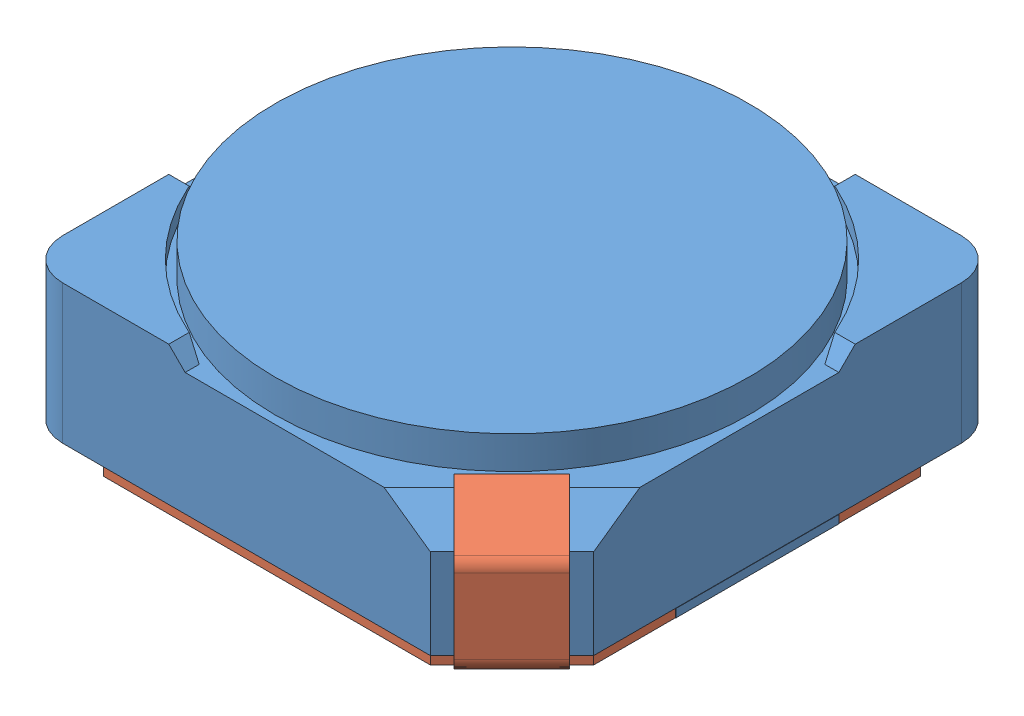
SolidWorks assembly User Library-CDRH5D18.SLDASM, configuration По умолчанию (file format 13000). Lengths in mm.
Overall size (6 2 6).
3 component instances, 2 part files, 6 mates.
Components (placement in the parent):
- User Library-CDRH5D18_CDRH5D18-Body-1: User Library-CDRH5D18_CDRH5D18-Body.SLDPRT [По умолчанию] at origin size (6 2 6)
- User Library-CDRH5D18_CDRH5D18-Contact-1: User Library-CDRH5D18_CDRH5D18-Contact.SLDPRT [По умолчанию] at origin size (6 1.77 2)
- User Library-CDRH5D18_CDRH5D18-Contact-2: User Library-CDRH5D18_CDRH5D18-Contact.SLDPRT [По умолчанию] x (-1 0 0) z (0 0 -1) size (6 1.77 2)
Mates (geometry in assembly coordinates):
- Концентричный3: concentric aligned: cylinder of CDRH5D18-Body-1 through (0 0.5 0) axis (0 -1 0) radius 2.3; cylinder of CDRH5D18-Contact-2 through (0 12.7491 0) axis (0 -1 0) radius 2.6767
- Совпадение3: coincident anti-aligned: plane of CDRH5D18-Body-1 through (0 0.1 0) normal (0 -1 0); plane of CDRH5D18-Contact-2 through (0 0.1 0) normal (0 1 0)
- Концентричный4: concentric aligned: cylinder of CDRH5D18-Body-1 through (0 0.5 0) axis (0 -1 0) radius 2.3; cylinder of CDRH5D18-Contact-1 through (0 12.7491 0) axis (0 -1 0) radius 2.6767
- Совпадение4: coincident anti-aligned: plane of CDRH5D18-Body-1 through (0 0.1 0) normal (0 -1 0); plane of CDRH5D18-Contact-1 through (0 0.1 0) normal (0 1 0)
- Совпадение5: coincident aligned: plane of CDRH5D18-Body-1 through (-2 2 -3) normal (0 0 -1); plane of CDRH5D18-Contact-1 through (2 12.7491 -3) normal (0 0 -1)
- Совпадение6: coincident aligned: plane of CDRH5D18-Body-1 through (-2.5 2 3) normal (0 0 1); plane of CDRH5D18-Contact-2 through (-2 12.7491 3) normal (0 0 1)
